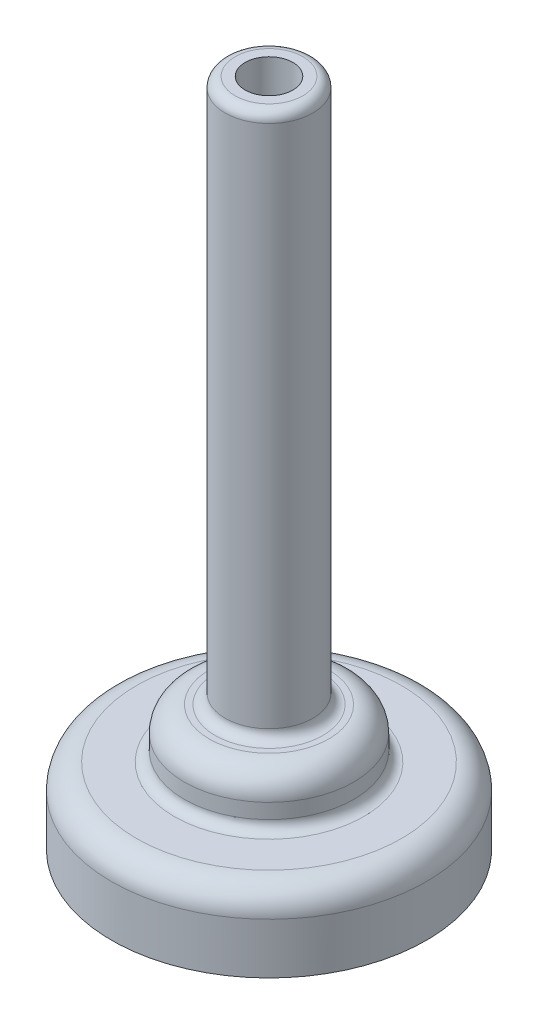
from build123d import *

# Parameters (mm, degrees)
FILLET1_R           = 1.5875
SHELL1_T            = -1.27
BOSS_EXTRUDE1_REACH = 46.969
SKETCH2_R           = 8.763
SKETCH2_R_2         = 8.255
FILLET2_R           = 0.635


with BuildPart() as part:
    # Sketch1 → Base-Revolve (revolve)
    with BuildSketch(Plane.XY, mode=Mode.PRIVATE) as base_revolve_sk:
        Polygon((0, 0), (-10.033, 0), (-10.033, 4.826), (-5.3975, 4.826), (-5.3975, 8.001), (-2.794, 8.001), (-2.794, 42.672), (0, 42.672), align=None)
    revolve(base_revolve_sk.sketch.rotate(Axis((0, 0, 0), (0, 1, 0)), 270), axis=Axis((0, 0, 0), (0, 1, 0)))

    # Fillet1
    fillet1_edges = [part.edges().sort_by_distance(p)[0] for p in [
        (0, 4.826, 10.033),
        (0, 8.001, 5.3975),
    ]]
    fillet(fillet1_edges, radius=FILLET1_R)

    # Shell1
    shell1_openings = [part.faces().sort_by_distance(p)[0] for p in [
        (0, 0, 0),
        (0, 42.672, 0),
    ]]
    offset(amount=SHELL1_T, openings=shell1_openings, kind=Kind.INTERSECTION)

    # Sketch2 → Boss-Extrude1 (add, up to next)
    with BuildSketch(Plane.XZ, mode=Mode.PRIVATE) as boss_extrude1_sk1:
        Circle(SKETCH2_R)
        with Locations(Location((0, 0, 0), (0, 0, 270))):
            Circle(SKETCH2_R_2, mode=Mode.SUBTRACT)
    boss_extrude1_tool1 = extrude(boss_extrude1_sk1.sketch, amount=-BOSS_EXTRUDE1_REACH, mode=Mode.PRIVATE) - part.part
    add(boss_extrude1_tool1.solids().sort_by_distance((-8.515145, 0, 0))[0])

    # Fillet2
    fillet2_edges = [part.edges().sort_by_distance(p)[0] for p in [
        (0, 6.731, 1.524),
        (0, 3.556, 4.1275),
        (0, 3.556, 8.255),
        (0, 4.826, 5.3975),
        (0, 8.001, 2.794),
        (0, 42.672, 2.794),
    ]]
    fillet(fillet2_edges, radius=FILLET2_R)


solid = part.part
